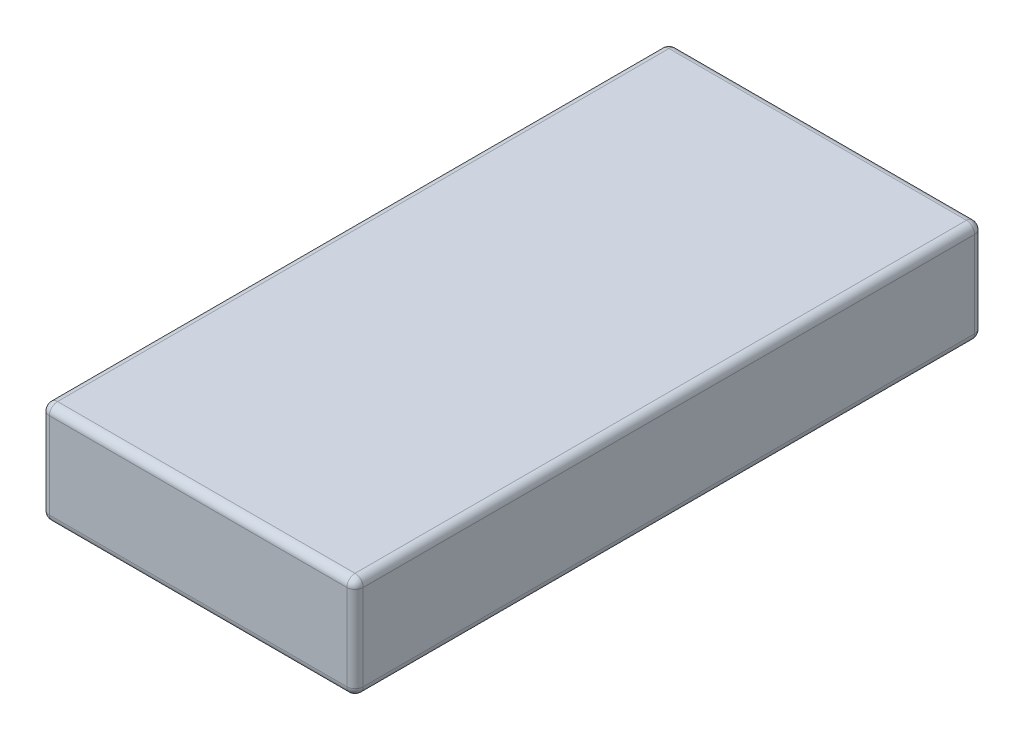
from build123d import *

# Parameters (mm, degrees)
SKETCH1_W           = 115
SKETCH1_H           = 37.5
BOSS_EXTRUDE1_DEPTH = 115
FILLET1_R           = 3


with BuildPart() as part:
    # Sketch1 → Boss-Extrude1 (new, symmetric)
    with BuildSketch(Plane.XY):
        Rectangle(SKETCH1_W, SKETCH1_H)
    extrude(amount=BOSS_EXTRUDE1_DEPTH, both=True)

    # Fillet1
    fillet1_edges = [part.edges().sort_by_distance(p)[0] for p in [
        (-57.5, 0, 115),
        (0, -18.75, 115),
        (57.5, 0, 115),
        (0, -18.75, -115),
        (-57.5, 0, -115),
        (0, 18.75, -115),
        (57.5, 0, -115),
        (57.5, -18.75, 0),
        (-57.5, -18.75, 0),
        (-57.5, 18.75, 0),
        (57.5, 18.75, 0),
        (0, 18.75, 115),
    ]]
    fillet(fillet1_edges, radius=FILLET1_R)


solid = part.part
